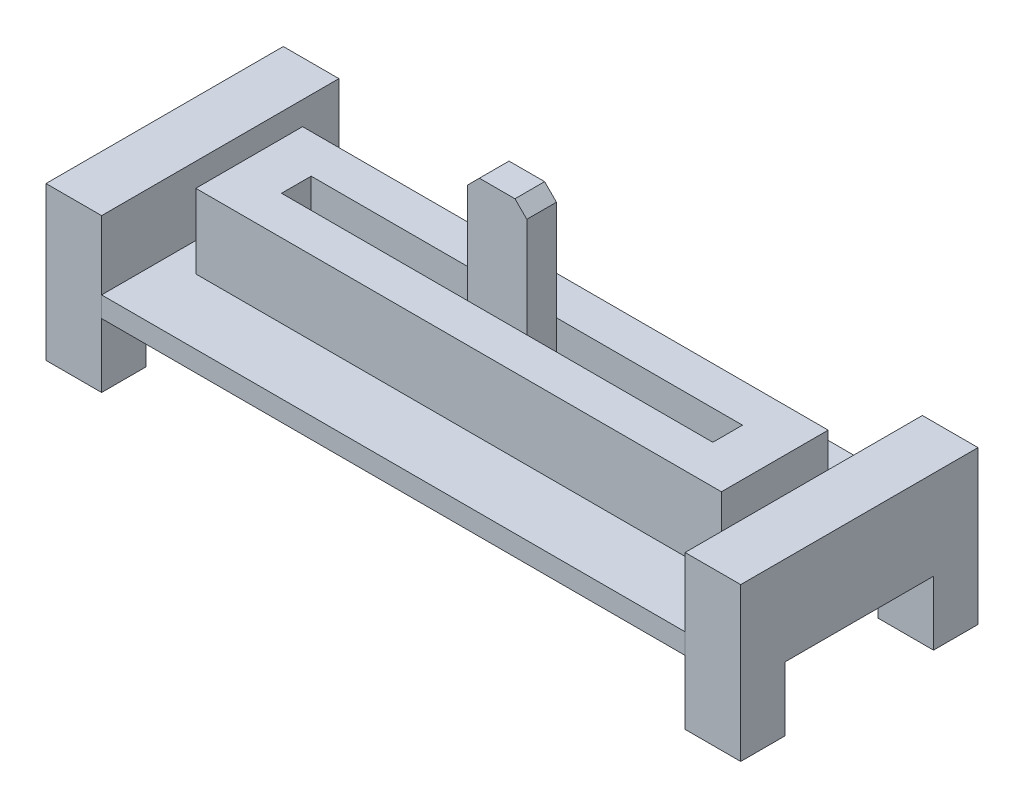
from build123d import *

# Parameters (mm, degrees)
SKETCH1_W           = 45.0088
SKETCH1_H           = 9.144
BOSS_EXTRUDE1_DEPTH = 6.35
SKETCH2_W           = 36.9316
SKETCH2_H           = 2.54
CUT_EXTRUDE1_DEPTH  = 3.175
SKETCH3_W           = 5.08
SKETCH3_H           = 12.7635
BOSS_EXTRUDE2_DEPTH = 2.54
CHAMFER1_SIZE       = 1.016
SKETCH4_W           = 49.9618
SKETCH4_H           = 20.32
BOSS_EXTRUDE3_DEPTH = 1.7526
BOSS_EXTRUDE4_DEPTH = 4.7625
BOSS_EXTRUDE5_DEPTH = 4.7625


with BuildPart() as part:
    # Sketch1 → Boss-Extrude1 (new body)
    with BuildSketch(Plane(origin=(0, 0, 0), x_dir=(1, 0, 0), z_dir=(0, 1, 0))):
        Rectangle(SKETCH1_W, SKETCH1_H)
    extrude(amount=BOSS_EXTRUDE1_DEPTH)

    # Sketch2 → Cut-Extrude1 (cut)
    with BuildSketch(Plane(origin=(0, 6.35, 0), x_dir=(1, 0, 0), z_dir=(0, 1, 0))):
        Rectangle(SKETCH2_W, SKETCH2_H)
    extrude(amount=-CUT_EXTRUDE1_DEPTH, mode=Mode.SUBTRACT)

    # Sketch3 → Boss-Extrude2 (add)
    with BuildSketch(Plane.XY.offset(-1.27)):
        with Locations((0, 9.55675)):
            Rectangle(SKETCH3_W, SKETCH3_H)
    extrude(amount=BOSS_EXTRUDE2_DEPTH)

    # Chamfer1
    chamfer1_edges = [part.edges().sort_by_distance(p)[0] for p in [
        (-2.54, 15.9385, 0),
        (2.54, 15.9385, 0),
    ]]
    chamfer(chamfer1_edges, length=CHAMFER1_SIZE)

    # Sketch4 → Boss-Extrude3 (add)
    with BuildSketch(Plane.XZ):
        Rectangle(SKETCH4_W, SKETCH4_H)
    extrude(amount=BOSS_EXTRUDE3_DEPTH)


with BuildPart() as body_2:
    # Sketch6 → Boss-Extrude4 (new body)
    with BuildSketch(Plane.ZY.offset(24.9809)):
        Polygon((-10.16, 5.8801), (10.16, 5.8801), (10.16, -7.239), (6.35, -7.239), (6.35, -1.7526), (0, -1.7526), (-6.35, -1.7526), (-6.35, -7.239), (-10.16, -7.239), align=None)
    extrude(amount=BOSS_EXTRUDE4_DEPTH)


with BuildPart() as body_3:
    # Sketch7 → Boss-Extrude5 (new body)
    with BuildSketch(Plane(origin=(24.9809, 0, 0), x_dir=(0, 0, -1), z_dir=(1, 0, 0))):
        Polygon((10.16, -7.239), (10.16, 5.8801), (-10.16, 5.8801), (-10.16, -7.239), (-6.35, -7.239), (-6.35, -1.7526), (6.35, -1.7526), (6.35, -7.239), align=None)
    extrude(amount=BOSS_EXTRUDE5_DEPTH)


solid = Compound([part.part, body_2.part, body_3.part])
